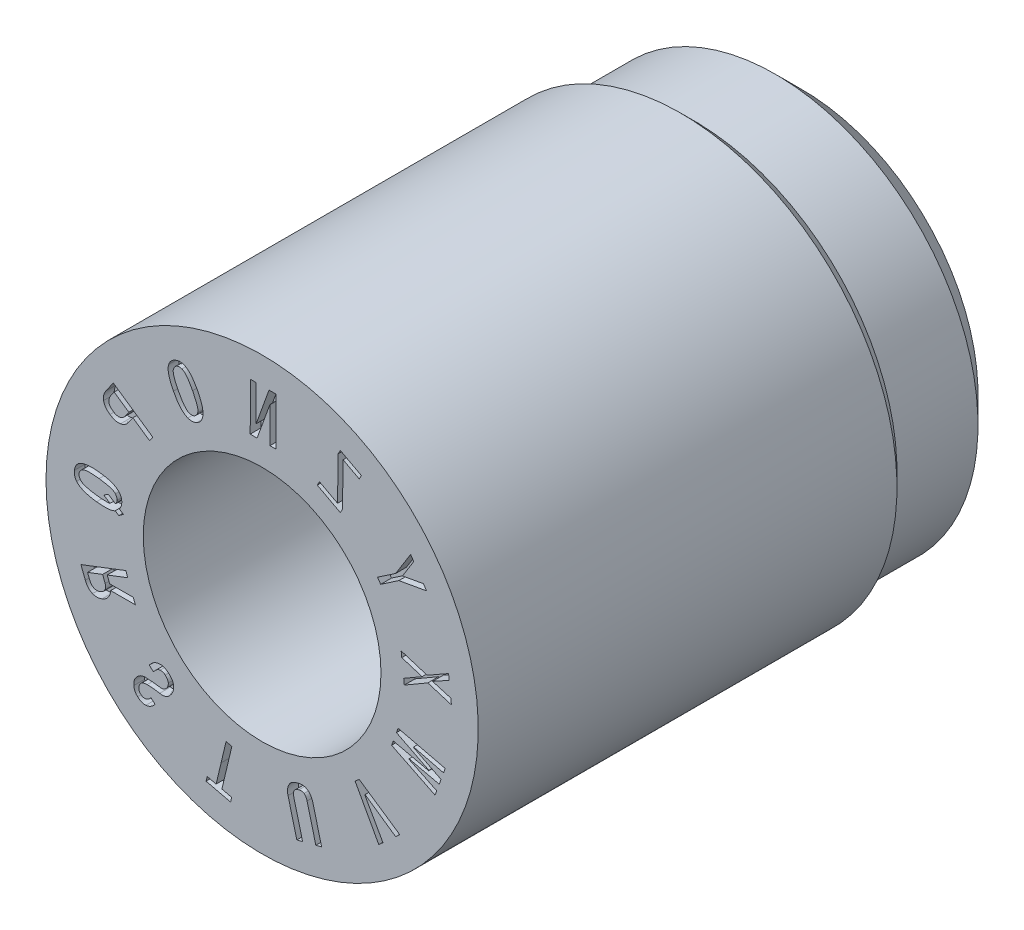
from build123d import *

# Parameters (mm, degrees)
CUT_EXTRUDE1_DEPTH = 0.2


with BuildPart() as part:
    # Sketch2 → Revolve1 (revolve)
    with BuildSketch(Plane(origin=(0, 0, 0), x_dir=(1, 0, 0), z_dir=(0, 1, 0)), mode=Mode.PRIVATE) as revolve1_sk:
        Polygon((3.249621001, 10), (1.15, 10), (1.15, 7.468), (2.2, 7.468), (2.2, 0), (4, 0), (4, 7.75), (3.75, 8), (3.75, 9.499621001), align=None)
    revolve(revolve1_sk.sketch.rotate(Axis((0, 0, -4.849143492), (0, 0, 1)), 180), axis=Axis((0, 0, -4.849143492), (0, 0, 1)))

    # Sketch7 → Cut-Extrude1 (cut)
    # profile 1 of 13: a face of its own
    with BuildSketch(Plane.XY):
        Polygon((3.053546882, 0.392480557), (2.573473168, 0.543387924), (2.584896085, 0.440311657), (2.961538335, 0.323248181), (2.619864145, 0.126430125), (2.631287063, 0.023353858), (3.066593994, 0.276026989), (3.503512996, 0.142929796), (3.491926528, 0.245969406), (3.154276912, 0.344633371), (3.462203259, 0.514992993), (3.450780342, 0.618069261), align=None)
    # profile 2 of 13: a face of its own
    with BuildSketch(Plane.XY):
        Polygon((2.986004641, 1.826017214), (2.603221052, 1.756872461), (2.600728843, 1.76057469), (2.806566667, 2.090772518), (2.748374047, 2.17645236), (2.472203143, 1.733386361), (2.136421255, 1.505786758), (2.194458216, 1.420169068), (2.530240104, 1.647768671), (3.044135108, 1.740181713), align=None)
    # profile 3 of 13: a face of its own
    with BuildSketch(Plane.XY):
        Polygon((1.837182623, 2.984767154), (1.446788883, 3.192726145), (1.406519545, 3.117068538), (1.396010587, 2.319843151), (1.061487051, 2.498074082), (1.021494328, 2.42320755), (1.44764493, 2.196246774), (1.487637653, 2.271113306), (1.498516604, 3.06899058), (1.7971899, 2.909900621), align=None)
    # profile 4 of 13: a face of its own
    with BuildSketch(Plane.XY):
        Polygon((-0.216255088, 3.501940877), (-0.220347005, 2.619822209), (-0.093635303, 2.619279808), (0.144786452, 3.278550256), (0.149311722, 3.278512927), (0.146210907, 2.61813939), (0.253311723, 2.617591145), (0.25740364, 3.499709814), (0.127675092, 3.5002771), (-0.110749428, 2.840671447), (-0.112257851, 2.84068389), (-0.109154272, 3.501392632), align=None)
    # profile 5 of 13: a face of its own
    with BuildSketch(Plane.XY):
        with BuildLine():
            add(Edge.make_bspline(
                [(-1.729374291, 2.98262397), (-1.731008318, 2.976912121), (-1.73434862, 2.96523587), (-1.737598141, 2.946947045), (-1.739421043, 2.927796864), (-1.73989398, 2.907786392), (-1.739195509, 2.886890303), (-1.736793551, 2.86506842), (-1.733524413, 2.842316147), (-1.728638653, 2.818709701), (-1.722168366, 2.794306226), (-1.714835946, 2.768885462), (-1.705775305, 2.74270965), (-1.695622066, 2.715570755), (-1.684040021, 2.687541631), (-1.671087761, 2.658559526), (-1.656856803, 2.628656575), (-1.646511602, 2.60863748), (-1.641244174, 2.598444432)],
                knots=[0, 0, 0, 0, 0.706757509, 1.444764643, 2.206913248, 2.994457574, 3.825681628, 4.693371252, 5.606017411, 6.56083591, 7.560518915, 8.610470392, 9.709055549, 10.8563712, 12.059009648, 13.318052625, 14.634442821, 16, 16, 16, 16], degree=3))
            add(Edge.make_bspline(
                [(-1.641244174, 2.598444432), (-1.635811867, 2.588115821), (-1.625167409, 2.567877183), (-1.608324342, 2.538808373), (-1.591962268, 2.511076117), (-1.575135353, 2.485254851), (-1.558718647, 2.460844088), (-1.542126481, 2.438208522), (-1.525287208, 2.417381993), (-1.508629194, 2.397998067), (-1.492015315, 2.38019884), (-1.475165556, 2.364301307), (-1.458562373, 2.349706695), (-1.441677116, 2.337002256), (-1.424861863, 2.325877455), (-1.4080493, 2.316367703), (-1.391146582, 2.308677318), (-1.379681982, 2.304670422), (-1.374064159, 2.302706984)],
                knots=[0, 0, 0, 0, 1.373774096, 2.691873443, 3.954807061, 5.16408426, 6.319665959, 7.417948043, 8.466946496, 9.472007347, 10.426643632, 11.331798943, 12.19837133, 13.027801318, 13.817360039, 14.570689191, 15.299616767, 16, 16, 16, 16], degree=3))
            add(Edge.make_bspline(
                [(-1.374064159, 2.302706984), (-1.367085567, 2.300155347), (-1.353362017, 2.2951375), (-1.332377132, 2.289806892), (-1.311416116, 2.287567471), (-1.29059895, 2.287173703), (-1.269928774, 2.289373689), (-1.249342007, 2.29393379), (-1.228954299, 2.300958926), (-1.215828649, 2.307338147), (-1.209179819, 2.310569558)],
                knots=[0, 0, 0, 0, 1.044490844, 2.054013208, 3.034543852, 4.001896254, 4.976620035, 5.94944278, 6.961285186, 8, 8, 8, 8], degree=3))
            add(Edge.make_bspline(
                [(-1.209179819, 2.310569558), (-1.202416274, 2.314365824), (-1.189145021, 2.32181476), (-1.171005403, 2.33510216), (-1.154597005, 2.34949821), (-1.140669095, 2.365751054), (-1.12821611, 2.382981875), (-1.118331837, 2.401970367), (-1.110105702, 2.42215935), (-1.106382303, 2.436355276), (-1.104493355, 2.443557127)],
                knots=[0, 0, 0, 0, 1.063112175, 2.086011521, 3.078717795, 4.05037152, 5.016112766, 5.988642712, 6.979601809, 8, 8, 8, 8], degree=3))
            add(Edge.make_bspline(
                [(-1.104493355, 2.443557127), (-1.102843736, 2.449266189), (-1.099465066, 2.460959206), (-1.096465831, 2.479316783), (-1.094560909, 2.498552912), (-1.0941141, 2.518684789), (-1.09509152, 2.539714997), (-1.097161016, 2.561726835), (-1.100946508, 2.584605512), (-1.105743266, 2.608460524), (-1.11227235, 2.633143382), (-1.119797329, 2.658844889), (-1.129070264, 2.685419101), (-1.139370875, 2.712981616), (-1.151166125, 2.741463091), (-1.164443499, 2.770761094), (-1.178889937, 2.801111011), (-1.189344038, 2.821439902), (-1.194682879, 2.831821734)],
                knots=[0, 0, 0, 0, 0.699060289, 1.431780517, 2.185628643, 2.973706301, 3.799840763, 4.663081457, 5.57484828, 6.528566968, 7.526638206, 8.579531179, 9.68064661, 10.839179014, 12.043340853, 13.308967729, 14.625707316, 16, 16, 16, 16], degree=3))
            add(Edge.make_bspline(
                [(-1.194682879, 2.831821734), (-1.200056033, 2.841954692), (-1.210592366, 2.86182463), (-1.227054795, 2.890534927), (-1.243258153, 2.917805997), (-1.259713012, 2.943337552), (-1.276146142, 2.967268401), (-1.292678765, 2.989538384), (-1.309098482, 3.010302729), (-1.325854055, 3.02919985), (-1.342391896, 3.046705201), (-1.359006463, 3.06259218), (-1.375634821, 3.076803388), (-1.392232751, 3.089512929), (-1.409088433, 3.100277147), (-1.425809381, 3.109826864), (-1.442723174, 3.117500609), (-1.454186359, 3.121509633), (-1.459803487, 3.123474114)],
                knots=[0, 0, 0, 0, 1.365114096, 2.676882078, 3.938888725, 5.140526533, 6.291695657, 7.393657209, 8.441474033, 9.441477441, 10.398776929, 11.307345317, 12.176177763, 13.001467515, 13.793283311, 14.554922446, 15.291890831, 16, 16, 16, 16], degree=3))
            add(Edge.make_bspline(
                [(-1.459803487, 3.123474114), (-1.466462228, 3.125349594), (-1.479668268, 3.129069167), (-1.499983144, 3.131995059), (-1.52039051, 3.132804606), (-1.540941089, 3.131535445), (-1.561620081, 3.128035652), (-1.582431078, 3.122285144), (-1.603402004, 3.114462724), (-1.617040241, 3.107726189), (-1.62397769, 3.104299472)],
                knots=[0, 0, 0, 0, 0.976897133, 1.937444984, 2.892524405, 3.859380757, 4.842164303, 5.851181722, 6.906946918, 8, 8, 8, 8], degree=3))
            add(Edge.make_bspline(
                [(-1.62397769, 3.104299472), (-1.630494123, 3.100735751), (-1.64327991, 3.093743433), (-1.660822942, 3.08134929), (-1.676663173, 3.067826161), (-1.69073552, 3.053126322), (-1.703240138, 3.037335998), (-1.713828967, 3.020265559), (-1.722684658, 3.001988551), (-1.727129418, 2.989122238), (-1.729374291, 2.98262397)],
                knots=[0, 0, 0, 0, 1.076833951, 2.112838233, 3.109604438, 4.094401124, 5.060642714, 6.026442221, 7.003233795, 8, 8, 8, 8], degree=3))
        make_face()
        with BuildLine():
            add(Edge.make_bspline(
                [(-1.48470361, 3.033618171), (-1.481304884, 3.03236822), (-1.474254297, 3.029775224), (-1.463775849, 3.024256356), (-1.453055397, 3.017164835), (-1.442104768, 3.008399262), (-1.430763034, 2.998315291), (-1.419225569, 2.986504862), (-1.407415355, 2.973158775), (-1.395168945, 2.958320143), (-1.382778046, 2.941846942), (-1.369876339, 2.923928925), (-1.35676128, 2.904403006), (-1.343439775, 2.883193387), (-1.32978376, 2.860468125), (-1.315739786, 2.836248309), (-1.301639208, 2.810378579), (-1.292141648, 2.792620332), (-1.287263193, 2.783498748)],
                knots=[0, 0, 0, 0, 0.535693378, 1.111284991, 1.748431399, 2.436238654, 3.186244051, 3.994178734, 4.878956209, 5.824301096, 6.841871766, 7.930239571, 9.093073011, 10.323688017, 11.638103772, 13.018336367, 14.468458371, 16, 16, 16, 16], degree=3))
            add(Edge.make_bspline(
                [(-1.287263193, 2.783498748), (-1.282416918, 2.774187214), (-1.27294076, 2.755979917), (-1.259706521, 2.729040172), (-1.247593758, 2.703228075), (-1.236509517, 2.678663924), (-1.226644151, 2.655212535), (-1.217785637, 2.633012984), (-1.210143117, 2.611980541), (-1.203596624, 2.592119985), (-1.19839131, 2.573359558), (-1.193867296, 2.555829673), (-1.190803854, 2.539407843), (-1.188881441, 2.524151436), (-1.188007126, 2.510062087), (-1.188114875, 2.497075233), (-1.189496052, 2.485239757), (-1.191478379, 2.477932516), (-1.1924193, 2.474464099)],
                knots=[0, 0, 0, 0, 1.532193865, 2.995973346, 4.380747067, 5.694013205, 6.929307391, 8.094137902, 9.182462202, 10.19533062, 11.145524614, 12.023925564, 12.837020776, 13.581992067, 14.267209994, 14.895995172, 15.47597886, 16, 16, 16, 16], degree=3))
            add(Edge.make_bspline(
                [(-1.1924193, 2.474464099), (-1.193907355, 2.470013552), (-1.196817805, 2.461308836), (-1.202567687, 2.449012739), (-1.20901322, 2.437655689), (-1.216204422, 2.427201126), (-1.22432974, 2.417844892), (-1.2334086, 2.409623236), (-1.243178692, 2.40216919), (-1.250351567, 2.39819951), (-1.253964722, 2.396199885)],
                knots=[0, 0, 0, 0, 1.10032407, 2.152096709, 3.178732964, 4.16193185, 5.124641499, 6.078744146, 7.032216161, 8, 8, 8, 8], degree=3))
            add(Edge.make_bspline(
                [(-1.253964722, 2.396199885), (-1.257332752, 2.39452094), (-1.264057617, 2.391168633), (-1.274965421, 2.387952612), (-1.286204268, 2.385433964), (-1.297994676, 2.384462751), (-1.310182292, 2.384807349), (-1.322857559, 2.385933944), (-1.335979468, 2.3885991), (-1.344759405, 2.391128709), (-1.3492597, 2.392425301)],
                knots=[0, 0, 0, 0, 0.920265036, 1.837471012, 2.776779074, 3.738947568, 4.726011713, 5.761705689, 6.852726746, 8, 8, 8, 8], degree=3))
            add(Edge.make_bspline(
                [(-1.3492597, 2.392425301), (-1.352656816, 2.393677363), (-1.359756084, 2.396293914), (-1.370305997, 2.401812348), (-1.380950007, 2.409209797), (-1.392093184, 2.417918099), (-1.403361, 2.428345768), (-1.415155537, 2.440156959), (-1.426958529, 2.453843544), (-1.439377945, 2.468941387), (-1.451925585, 2.485696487), (-1.464905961, 2.50395064), (-1.478194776, 2.523805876), (-1.491801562, 2.545278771), (-1.50558536, 2.568453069), (-1.519729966, 2.593130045), (-1.534261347, 2.619418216), (-1.54386504, 2.63754542), (-1.548801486, 2.646863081)],
                knots=[0, 0, 0, 0, 0.528063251, 1.103542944, 1.731455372, 2.417605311, 3.166044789, 3.97048745, 4.852517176, 5.802311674, 6.823421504, 7.90670989, 9.071136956, 10.309930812, 11.616407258, 13.006063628, 14.461070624, 16, 16, 16, 16], degree=3))
            add(Edge.make_bspline(
                [(-1.548801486, 2.646863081), (-1.553533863, 2.656037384), (-1.562771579, 2.673945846), (-1.575804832, 2.70039417), (-1.587910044, 2.725630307), (-1.598599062, 2.749880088), (-1.608309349, 2.772938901), (-1.616986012, 2.794811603), (-1.62443966, 2.815566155), (-1.630925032, 2.835147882), (-1.636199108, 2.853644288), (-1.640285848, 2.871031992), (-1.643391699, 2.887194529), (-1.64528838, 2.902263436), (-1.646020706, 2.916222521), (-1.645685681, 2.929082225), (-1.644487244, 2.940854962), (-1.642495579, 2.948112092), (-1.64154401, 2.951579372)],
                knots=[0, 0, 0, 0, 1.528867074, 2.984386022, 4.366875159, 5.673880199, 6.908886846, 8.072441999, 9.158443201, 10.174578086, 11.127064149, 12.005972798, 12.819293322, 13.563507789, 14.253686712, 14.887117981, 15.468292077, 16, 16, 16, 16], degree=3))
            add(Edge.make_bspline(
                [(-1.64154401, 2.951579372), (-1.640039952, 2.956023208), (-1.637112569, 2.96467235), (-1.631677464, 2.976876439), (-1.625592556, 2.988077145), (-1.618779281, 2.998168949), (-1.611307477, 3.007310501), (-1.602837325, 3.015099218), (-1.594005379, 3.022328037), (-1.587376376, 3.025973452), (-1.584083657, 3.02778418)],
                knots=[0, 0, 0, 0, 1.148548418, 2.235447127, 3.267559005, 4.266574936, 5.214324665, 6.150945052, 7.081548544, 8, 8, 8, 8], degree=3))
            add(Edge.make_bspline(
                [(-1.584083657, 3.02778418), (-1.580414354, 3.029582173), (-1.573048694, 3.033191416), (-1.561390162, 3.036995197), (-1.549366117, 3.039672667), (-1.537056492, 3.041036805), (-1.524402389, 3.041114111), (-1.51142738, 3.039849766), (-1.498062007, 3.037553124), (-1.489198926, 3.034942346), (-1.48470361, 3.033618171)],
                knots=[0, 0, 0, 0, 0.957927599, 1.922917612, 2.869290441, 3.844910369, 4.823433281, 5.833338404, 6.901078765, 8, 8, 8, 8], degree=3))
        make_face(mode=Mode.SUBTRACT)
    # profile 6 of 13: a face of its own
    with BuildSketch(Plane.XY):
        with BuildLine():
            add(Edge.make_bspline(
                [(-2.888817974, 1.979295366), (-2.893680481, 1.971884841), (-2.903148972, 1.957454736), (-2.915107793, 1.935083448), (-2.924294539, 1.912654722), (-2.931515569, 1.890430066), (-2.935731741, 1.868099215), (-2.938065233, 1.845913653), (-2.937565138, 1.823658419), (-2.935379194, 1.809048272), (-2.934281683, 1.801712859)],
                knots=[0, 0, 0, 0, 1.129469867, 2.199354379, 3.227072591, 4.21583249, 5.172262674, 6.118162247, 7.055173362, 8, 8, 8, 8], degree=3))
            add(Edge.make_bspline(
                [(-2.934281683, 1.801712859), (-2.93258243, 1.793890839), (-2.929185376, 1.778253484), (-2.920828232, 1.755587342), (-2.909796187, 1.733817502), (-2.896208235, 1.712845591), (-2.879984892, 1.692681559), (-2.861276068, 1.673271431), (-2.839926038, 1.654609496), (-2.82421104, 1.643351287), (-2.816118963, 1.637554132)],
                knots=[0, 0, 0, 0, 0.92398886, 1.847188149, 2.781782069, 3.738954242, 4.729060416, 5.767402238, 6.850375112, 8, 8, 8, 8], degree=3))
            add(Edge.make_bspline(
                [(-2.816118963, 1.637554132), (-2.807838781, 1.632123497), (-2.791707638, 1.621543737), (-2.766833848, 1.608028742), (-2.741986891, 1.59764755), (-2.717491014, 1.589416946), (-2.693069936, 1.584347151), (-2.668842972, 1.581990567), (-2.644756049, 1.582148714), (-2.628945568, 1.584485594), (-2.621028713, 1.58565575)],
                knots=[0, 0, 0, 0, 1.146139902, 2.232867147, 3.271325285, 4.260259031, 5.220169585, 6.151590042, 7.074437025, 8, 8, 8, 8], degree=3))
            add(Edge.make_bspline(
                [(-2.621028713, 1.58565575), (-2.613425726, 1.586967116), (-2.598371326, 1.589563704), (-2.576635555, 1.596737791), (-2.555829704, 1.606049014), (-2.535995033, 1.617763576), (-2.517084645, 1.631805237), (-2.499333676, 1.648413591), (-2.482269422, 1.667235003), (-2.472178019, 1.681285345), (-2.467002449, 1.688491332)],
                knots=[0, 0, 0, 0, 0.969249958, 1.919177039, 2.869493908, 3.831815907, 4.81057165, 5.825780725, 6.884909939, 8, 8, 8, 8], degree=3))
            Line((-2.467002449, 1.688491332), (-2.392293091, 1.79668099))
            Line((-2.392293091, 1.79668099), (-2.082759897, 1.583334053))
            Line((-2.082759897, 1.583334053), (-2.023722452, 1.669070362))
            Line((-2.023722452, 1.669070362), (-2.755071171, 2.173221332))
            Line((-2.755071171, 2.173221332), (-2.888817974, 1.979295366))
        make_face()
        with BuildLine():
            Line((-2.739077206, 2.035854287), (-2.467167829, 1.848371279))
            Line((-2.467167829, 1.848371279), (-2.526361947, 1.762575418))
            add(Edge.make_bspline(
                [(-2.526361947, 1.762575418), (-2.530227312, 1.75718067), (-2.537748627, 1.746683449), (-2.550178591, 1.732459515), (-2.563052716, 1.719875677), (-2.576604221, 1.709268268), (-2.590438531, 1.699986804), (-2.605116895, 1.692959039), (-2.620147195, 1.687213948), (-2.630584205, 1.684981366), (-2.635768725, 1.683872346)],
                knots=[0, 0, 0, 0, 1.150051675, 2.237796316, 3.270584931, 4.266229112, 5.218127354, 6.152114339, 7.082074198, 8, 8, 8, 8], degree=3))
            add(Edge.make_bspline(
                [(-2.635768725, 1.683872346), (-2.640561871, 1.683179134), (-2.650156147, 1.681791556), (-2.664944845, 1.681919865), (-2.679974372, 1.683805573), (-2.695439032, 1.687222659), (-2.710964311, 1.693054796), (-2.72702366, 1.700017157), (-2.743354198, 1.708952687), (-2.753989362, 1.716034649), (-2.759478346, 1.719689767)],
                knots=[0, 0, 0, 0, 0.878374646, 1.758212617, 2.674828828, 3.625830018, 4.626040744, 5.680545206, 6.80289116, 8, 8, 8, 8], degree=3))
            add(Edge.make_bspline(
                [(-2.759478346, 1.719689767), (-2.764857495, 1.723497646), (-2.77532048, 1.730904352), (-2.789359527, 1.743196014), (-2.801926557, 1.755464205), (-2.812553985, 1.768259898), (-2.821523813, 1.781288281), (-2.828665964, 1.79475444), (-2.833978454, 1.808528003), (-2.836117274, 1.817997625), (-2.837171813, 1.822666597)],
                knots=[0, 0, 0, 0, 1.194100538, 2.322645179, 3.378915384, 4.375148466, 5.333320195, 6.241689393, 7.133069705, 8, 8, 8, 8], degree=3))
            add(Edge.make_bspline(
                [(-2.837171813, 1.822666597), (-2.837682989, 1.827722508), (-2.838710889, 1.837889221), (-2.837658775, 1.853358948), (-2.835446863, 1.869011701), (-2.831207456, 1.884859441), (-2.825547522, 1.90095195), (-2.818165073, 1.917322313), (-2.809061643, 1.933822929), (-2.801921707, 1.94456593), (-2.798271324, 1.950058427)],
                knots=[0, 0, 0, 0, 0.89405284, 1.797812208, 2.723562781, 3.677016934, 4.683063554, 5.727408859, 6.838108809, 8, 8, 8, 8], degree=3))
            Line((-2.798271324, 1.950058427), (-2.739077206, 2.035854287))
        make_face(mode=Mode.SUBTRACT)
    # profile 7 of 13: a face of its own
    with BuildSketch(Plane.XY):
        with BuildLine():
            add(Edge.make_bspline(
                [(-3.433597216, 0.258591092), (-3.429830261, 0.254012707), (-3.422145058, 0.244672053), (-3.408696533, 0.23198553), (-3.394084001, 0.219473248), (-3.377685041, 0.207950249), (-3.360031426, 0.196575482), (-3.340527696, 0.186464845), (-3.319842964, 0.176221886), (-3.297385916, 0.167214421), (-3.273504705, 0.158491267), (-3.248134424, 0.150201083), (-3.22109592, 0.143042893), (-3.192713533, 0.135805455), (-3.162664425, 0.12977328), (-3.131172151, 0.123970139), (-3.098117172, 0.118991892), (-3.075568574, 0.116101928), (-3.064032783, 0.114623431)],
                knots=[0, 0, 0, 0, 0.700804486, 1.429755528, 2.18357768, 2.97531138, 3.798909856, 4.666281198, 5.572552, 6.528929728, 7.526805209, 8.580813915, 9.685209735, 10.835401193, 12.045715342, 13.310353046, 14.62398523, 16, 16, 16, 16], degree=3))
            add(Edge.make_bspline(
                [(-3.064032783, 0.114623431), (-3.053959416, 0.113477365), (-3.034237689, 0.111233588), (-3.00516467, 0.10848964), (-2.977235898, 0.106592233), (-2.950471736, 0.105264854), (-2.924875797, 0.104630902), (-2.900433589, 0.104490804), (-2.877147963, 0.105276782), (-2.855022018, 0.106668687), (-2.834105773, 0.108596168), (-2.814300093, 0.111300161), (-2.795687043, 0.114618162), (-2.778206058, 0.118749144), (-2.761912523, 0.123378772), (-2.746746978, 0.128662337), (-2.732791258, 0.134794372), (-2.72408972, 0.139505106), (-2.719840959, 0.141805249)],
                knots=[0, 0, 0, 0, 1.389457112, 2.720291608, 4.001750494, 5.225641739, 6.392541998, 7.510561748, 8.57498812, 9.584922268, 10.548664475, 11.452995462, 12.323735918, 13.138724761, 13.913705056, 14.644292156, 15.338038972, 16, 16, 16, 16], degree=3))
            Line((-2.719840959, 0.141805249), (-2.652456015, 0.097414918))
            Line((-2.652456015, 0.097414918), (-2.567621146, 0.160199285))
            Line((-2.567621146, 0.160199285), (-2.643505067, 0.210092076))
            add(Edge.make_bspline(
                [(-2.643505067, 0.210092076), (-2.63768344, 0.217189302), (-2.625959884, 0.231481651), (-2.613083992, 0.256639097), (-2.603419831, 0.284243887), (-2.600442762, 0.303894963), (-2.598914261, 0.313984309)],
                knots=[0, 0, 0, 0, 0.956904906, 1.927009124, 2.935675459, 4, 4, 4, 4], degree=3))
            add(Edge.make_bspline(
                [(-2.598914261, 0.313984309), (-2.598217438, 0.321312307), (-2.596849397, 0.33569903), (-2.597070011, 0.357077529), (-2.5993179, 0.37766691), (-2.603617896, 0.397494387), (-2.609628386, 0.416590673), (-2.617790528, 0.43484365), (-2.627688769, 0.452452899), (-2.635842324, 0.463270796), (-2.639971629, 0.468749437)],
                knots=[0, 0, 0, 0, 1.07304745, 2.106665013, 3.11194997, 4.088692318, 5.06134729, 6.026188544, 7.000378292, 8, 8, 8, 8], degree=3))
            add(Edge.make_bspline(
                [(-2.639971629, 0.468749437), (-2.643759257, 0.473305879), (-2.651474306, 0.482586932), (-2.664559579, 0.495594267), (-2.679424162, 0.507688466), (-2.695393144, 0.519583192), (-2.713150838, 0.530538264), (-2.732286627, 0.540965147), (-2.752865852, 0.550984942), (-2.774926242, 0.560237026), (-2.798521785, 0.568820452), (-2.823529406, 0.576946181), (-2.850091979, 0.584382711), (-2.878146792, 0.59107692), (-2.90767135, 0.597410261), (-2.938760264, 0.602914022), (-2.971267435, 0.608114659), (-2.99349441, 0.610865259), (-3.004816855, 0.612266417)],
                knots=[0, 0, 0, 0, 0.708749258, 1.443656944, 2.203058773, 3.000131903, 3.824600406, 4.697053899, 5.607066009, 6.562126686, 7.558030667, 8.610656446, 9.707750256, 10.85759157, 12.06137803, 13.320330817, 14.634973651, 16, 16, 16, 16], degree=3))
            add(Edge.make_bspline(
                [(-3.004816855, 0.612266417), (-3.016353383, 0.613551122), (-3.03895497, 0.61606803), (-3.072247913, 0.618961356), (-3.104227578, 0.620861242), (-3.134887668, 0.621670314), (-3.164172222, 0.621784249), (-3.192138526, 0.620730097), (-3.218729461, 0.618765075), (-3.243982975, 0.615875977), (-3.267873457, 0.612214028), (-3.290440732, 0.607508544), (-3.311658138, 0.601750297), (-3.331614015, 0.595222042), (-3.350164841, 0.587676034), (-3.367342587, 0.579100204), (-3.383346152, 0.569838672), (-3.393005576, 0.562520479), (-3.397748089, 0.558927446)],
                knots=[0, 0, 0, 0, 1.373502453, 2.69087328, 3.953892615, 5.16362336, 6.319707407, 7.418497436, 8.474284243, 9.474002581, 10.425473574, 11.333293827, 12.200159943, 13.025655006, 13.816457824, 14.56725867, 15.296563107, 16, 16, 16, 16], degree=3))
            add(Edge.make_bspline(
                [(-3.397748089, 0.558927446), (-3.40302314, 0.554543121), (-3.413478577, 0.545853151), (-3.427247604, 0.530818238), (-3.439569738, 0.514689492), (-3.449765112, 0.496880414), (-3.458809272, 0.478050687), (-3.465605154, 0.457655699), (-3.47113645, 0.436083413), (-3.473221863, 0.421106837), (-3.474289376, 0.413440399)],
                knots=[0, 0, 0, 0, 0.973613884, 1.92975554, 2.889811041, 3.851702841, 4.840347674, 5.85305095, 6.900987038, 8, 8, 8, 8], degree=3))
            add(Edge.make_bspline(
                [(-3.474289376, 0.413440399), (-3.47498385, 0.406112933), (-3.47634728, 0.391727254), (-3.476159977, 0.370341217), (-3.473787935, 0.349752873), (-3.469926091, 0.329847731), (-3.463618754, 0.310817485), (-3.455689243, 0.292474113), (-3.44570402, 0.274905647), (-3.437659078, 0.264064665), (-3.433597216, 0.258591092)],
                knots=[0, 0, 0, 0, 1.073418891, 2.107394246, 3.113027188, 4.093976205, 5.060011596, 6.031670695, 7.006197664, 8, 8, 8, 8], degree=3))
        make_face()
        with BuildLine():
            add(Edge.make_bspline(
                [(-3.358781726, 0.313450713), (-3.361611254, 0.317179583), (-3.367093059, 0.324403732), (-3.374083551, 0.335692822), (-3.37993197, 0.346879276), (-3.384220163, 0.358253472), (-3.387711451, 0.369504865), (-3.389334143, 0.38088635), (-3.390036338, 0.392175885), (-3.389429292, 0.399638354), (-3.38912504, 0.403378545)],
                knots=[0, 0, 0, 0, 1.151888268, 2.231617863, 3.265601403, 4.253923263, 5.221346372, 6.158870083, 7.077225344, 8, 8, 8, 8], degree=3))
            add(Edge.make_bspline(
                [(-3.38912504, 0.403378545), (-3.388537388, 0.407429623), (-3.387370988, 0.415470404), (-3.383868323, 0.427161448), (-3.379531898, 0.438582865), (-3.37349677, 0.449385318), (-3.366488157, 0.459808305), (-3.358316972, 0.469894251), (-3.348753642, 0.479415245), (-3.3416839, 0.485299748), (-3.338083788, 0.488296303)],
                knots=[0, 0, 0, 0, 0.964087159, 1.913568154, 2.871332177, 3.839731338, 4.823603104, 5.831358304, 6.895666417, 8, 8, 8, 8], degree=3))
            add(Edge.make_bspline(
                [(-3.338083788, 0.488296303), (-3.335171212, 0.490423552), (-3.329086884, 0.494867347), (-3.318461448, 0.500097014), (-3.30656952, 0.505074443), (-3.293111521, 0.509147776), (-3.278193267, 0.512616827), (-3.261839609, 0.515524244), (-3.243976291, 0.51778178), (-3.224651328, 0.519205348), (-3.203840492, 0.520297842), (-3.181552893, 0.520476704), (-3.157761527, 0.520320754), (-3.132514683, 0.519340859), (-3.105768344, 0.517663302), (-3.077554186, 0.515532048), (-3.047833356, 0.51262158), (-3.027549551, 0.510358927), (-3.017136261, 0.509197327)],
                knots=[0, 0, 0, 0, 0.52827602, 1.103561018, 1.731564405, 2.419028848, 3.163240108, 3.978095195, 4.855033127, 5.803817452, 6.820634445, 7.912160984, 9.073427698, 10.311327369, 11.618637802, 13.005392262, 14.462629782, 16, 16, 16, 16], degree=3))
            add(Edge.make_bspline(
                [(-3.017136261, 0.509197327), (-3.0069331, 0.507902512), (-2.987040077, 0.505378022), (-2.957962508, 0.501338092), (-2.930456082, 0.49692625), (-2.904510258, 0.49224644), (-2.880201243, 0.487194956), (-2.857408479, 0.482080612), (-2.836098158, 0.476702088), (-2.816489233, 0.470590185), (-2.798240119, 0.464823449), (-2.781721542, 0.458402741), (-2.766749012, 0.451633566), (-2.753231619, 0.444903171), (-2.741356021, 0.437623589), (-2.730945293, 0.430262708), (-2.722167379, 0.422413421), (-2.717264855, 0.416791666), (-2.714910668, 0.414092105)],
                knots=[0, 0, 0, 0, 1.531324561, 2.985611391, 4.370687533, 5.678814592, 6.910634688, 8.067006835, 9.156839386, 10.181653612, 11.124605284, 12.005763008, 12.818241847, 13.570812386, 14.252156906, 14.890127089, 15.467040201, 16, 16, 16, 16], degree=3))
            add(Edge.make_bspline(
                [(-2.714910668, 0.414092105), (-2.712085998, 0.410360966), (-2.706613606, 0.40313242), (-2.699534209, 0.391838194), (-2.693892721, 0.380472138), (-2.689308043, 0.369218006), (-2.686001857, 0.357951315), (-2.684350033, 0.346659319), (-2.683658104, 0.335366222), (-2.684263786, 0.327904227), (-2.684567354, 0.324164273)],
                knots=[0, 0, 0, 0, 1.151942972, 2.231723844, 3.276226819, 4.272509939, 5.221214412, 6.158782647, 7.077181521, 8, 8, 8, 8], degree=3))
            add(Edge.make_bspline(
                [(-2.684567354, 0.324164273), (-2.685715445, 0.316514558), (-2.687872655, 0.302141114), (-2.694311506, 0.282672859), (-2.703333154, 0.266676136), (-2.711605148, 0.258847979), (-2.715569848, 0.255096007)],
                knots=[0, 0, 0, 0, 1.195186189, 2.245697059, 3.159176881, 4, 4, 4, 4], degree=3))
            Line((-2.715569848, 0.255096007), (-2.845985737, 0.343341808))
            Line((-2.845985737, 0.343341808), (-2.929672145, 0.289591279))
            Line((-2.929672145, 0.289591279), (-2.81605192, 0.212473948))
            add(Edge.make_bspline(
                [(-2.81605192, 0.212473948), (-2.823327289, 0.211512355), (-2.838627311, 0.209490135), (-2.862776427, 0.207935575), (-2.889083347, 0.206978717), (-2.917521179, 0.207190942), (-2.948059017, 0.208395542), (-2.980763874, 0.21064933), (-3.015605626, 0.213736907), (-3.039552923, 0.21637455), (-3.051876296, 0.217731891)],
                knots=[0, 0, 0, 0, 0.744522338, 1.565722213, 2.454318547, 3.415565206, 4.450729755, 5.555238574, 6.741916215, 8, 8, 8, 8], degree=3))
            add(Edge.make_bspline(
                [(-3.051876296, 0.217731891), (-3.062257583, 0.218996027), (-3.082500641, 0.221461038), (-3.112065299, 0.225678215), (-3.140010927, 0.230167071), (-3.16637893, 0.235023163), (-3.191178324, 0.239910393), (-3.214402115, 0.245170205), (-3.236009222, 0.250707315), (-3.255991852, 0.256552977), (-3.274368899, 0.262663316), (-3.291127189, 0.269187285), (-3.30640045, 0.275672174), (-3.320036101, 0.282623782), (-3.33211104, 0.289780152), (-3.342597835, 0.297301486), (-3.351508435, 0.305073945), (-3.356432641, 0.310745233), (-3.358781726, 0.313450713)],
                knots=[0, 0, 0, 0, 1.534946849, 2.993079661, 4.383024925, 5.688960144, 6.928182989, 8.092741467, 9.183505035, 10.201532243, 11.148125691, 12.024906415, 12.840537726, 13.58242723, 14.269737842, 14.898653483, 15.474604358, 16, 16, 16, 16], degree=3))
        make_face(mode=Mode.SUBTRACT)
    # profile 8 of 13: a face of its own
    with BuildSketch(Plane.XY):
        with BuildLine():
            add(Edge.make_bspline(
                [(-3.272398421, -1.247843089), (-3.268892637, -1.256418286), (-3.262035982, -1.273189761), (-3.249190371, -1.296642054), (-3.234888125, -1.318177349), (-3.218855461, -1.337736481), (-3.2012654, -1.355408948), (-3.181804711, -1.370801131), (-3.160866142, -1.384484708), (-3.145730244, -1.391667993), (-3.138083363, -1.395297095)],
                knots=[0, 0, 0, 0, 1.084282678, 2.120653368, 3.125624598, 4.108213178, 5.078060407, 6.039772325, 7.009663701, 8, 8, 8, 8], degree=3))
            add(Edge.make_bspline(
                [(-3.138083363, -1.395297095), (-3.131657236, -1.397886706), (-3.118800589, -1.403067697), (-3.098445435, -1.40812137), (-3.077294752, -1.410854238), (-3.055364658, -1.41141237), (-3.032646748, -1.409569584), (-3.0091997, -1.405304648), (-2.984874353, -1.399102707), (-2.968758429, -1.393179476), (-2.960504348, -1.39014578)],
                knots=[0, 0, 0, 0, 0.910593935, 1.821810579, 2.749769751, 3.711603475, 4.702430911, 5.742521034, 6.843788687, 8, 8, 8, 8], degree=3))
            add(Edge.make_bspline(
                [(-2.960504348, -1.39014578), (-2.952957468, -1.38706982), (-2.938203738, -1.381056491), (-2.917481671, -1.369990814), (-2.898377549, -1.357892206), (-2.88102486, -1.344356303), (-2.865479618, -1.329407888), (-2.851490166, -1.313225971), (-2.839155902, -1.295704), (-2.832537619, -1.283046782), (-2.829218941, -1.276699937)],
                knots=[0, 0, 0, 0, 1.099613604, 2.149683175, 3.16650134, 4.149406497, 5.115350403, 6.073369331, 7.033908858, 8, 8, 8, 8], degree=3))
            add(Edge.make_bspline(
                [(-2.829218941, -1.276699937), (-2.824976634, -1.267981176), (-2.816897, -1.25137597), (-2.808715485, -1.22611576), (-2.803662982, -1.202310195), (-2.80360523, -1.18682919), (-2.803577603, -1.179423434)],
                knots=[0, 0, 0, 0, 1.143023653, 2.176931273, 3.127885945, 4, 4, 4, 4], degree=3))
            Line((-2.803577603, -1.179423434), (-2.3463857, -1.178752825))
            Line((-2.3463857, -1.178752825), (-2.385315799, -1.077135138))
            Line((-2.385315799, -1.077135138), (-2.821353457, -1.079510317))
            Line((-2.821353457, -1.079510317), (-2.866751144, -0.960937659))
            Line((-2.866751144, -0.960937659), (-2.485943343, -0.814787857))
            Line((-2.485943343, -0.814787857), (-2.523016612, -0.718489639))
            Line((-2.523016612, -0.718489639), (-3.353311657, -1.037207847))
            Line((-3.353311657, -1.037207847), (-3.272398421, -1.247843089))
        make_face()
        with BuildLine():
            add(Edge.make_bspline(
                [(-2.90530558, -1.116520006), (-2.903801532, -1.12071747), (-2.900818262, -1.129043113), (-2.898211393, -1.14193962), (-2.896480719, -1.154827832), (-2.896397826, -1.167817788), (-2.897570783, -1.18086703), (-2.899989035, -1.194009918), (-2.904119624, -1.207083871), (-2.907568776, -1.215676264), (-2.909318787, -1.220035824)],
                knots=[0, 0, 0, 0, 1.004294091, 1.992010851, 2.960247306, 3.933390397, 4.914090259, 5.912041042, 6.940623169, 8, 8, 8, 8], degree=3))
            add(Edge.make_bspline(
                [(-2.909318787, -1.220035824), (-2.911201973, -1.223903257), (-2.914974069, -1.231649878), (-2.92250053, -1.242437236), (-2.931448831, -1.252508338), (-2.941989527, -1.26186666), (-2.953791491, -1.270739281), (-2.967169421, -1.278830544), (-2.981959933, -1.286235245), (-2.992464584, -1.290543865), (-2.997876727, -1.292763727)],
                knots=[0, 0, 0, 0, 0.87676147, 1.756187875, 2.674094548, 3.620452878, 4.627958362, 5.683481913, 6.80649746, 8, 8, 8, 8], degree=3))
            add(Edge.make_bspline(
                [(-2.997876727, -1.292763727), (-3.003086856, -1.294625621), (-3.013287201, -1.298270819), (-3.028719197, -1.302278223), (-3.043806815, -1.304513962), (-3.058507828, -1.305509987), (-3.072923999, -1.304869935), (-3.086998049, -1.30267882), (-3.100812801, -1.299157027), (-3.109575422, -1.295587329), (-3.113999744, -1.293784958)],
                knots=[0, 0, 0, 0, 1.11294805, 2.178919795, 3.20157159, 4.177691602, 5.13953141, 6.098146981, 7.039738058, 8, 8, 8, 8], degree=3))
            add(Edge.make_bspline(
                [(-3.113999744, -1.293784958), (-3.118340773, -1.291261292), (-3.127021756, -1.286214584), (-3.139314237, -1.277202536), (-3.150501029, -1.266540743), (-3.161241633, -1.254770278), (-3.17089635, -1.241417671), (-3.179704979, -1.226706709), (-3.188052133, -1.210833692), (-3.192578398, -1.199472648), (-3.194901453, -1.193641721)],
                knots=[0, 0, 0, 0, 0.915536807, 1.830846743, 2.771888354, 3.729772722, 4.733603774, 5.770860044, 6.855919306, 8, 8, 8, 8], degree=3))
            Line((-3.194901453, -1.193641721), (-3.230603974, -1.100619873))
            Line((-3.230603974, -1.100619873), (-2.952385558, -0.993823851))
            Line((-2.952385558, -0.993823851), (-2.90530558, -1.116520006))
        make_face(mode=Mode.SUBTRACT)
    # profile 9 of 13: a face of its own
    with BuildSketch(Plane.XY):
        with BuildLine():
            add(Edge.make_bspline(
                [(-2.127883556, -2.348291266), (-2.107439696, -2.348752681), (-2.067295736, -2.349658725), (-2.008181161, -2.354245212), (-1.951273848, -2.3611192), (-1.914322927, -2.368042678), (-1.896170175, -2.371443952)],
                knots=[0, 0, 0, 0, 1.052096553, 2.06591721, 3.049849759, 4, 4, 4, 4], degree=3))
            add(Edge.make_bspline(
                [(-1.896170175, -2.371443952), (-1.886706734, -2.373108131), (-1.868307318, -2.376343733), (-1.840886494, -2.377314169), (-1.81480926, -2.374640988), (-1.789969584, -2.368947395), (-1.766558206, -2.35936063), (-1.744480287, -2.346540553), (-1.723689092, -2.330285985), (-1.711508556, -2.317264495), (-1.705271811, -2.31059716)],
                knots=[0, 0, 0, 0, 1.091982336, 2.123100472, 3.10858267, 4.066533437, 5.01132608, 5.97430108, 6.962790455, 8, 8, 8, 8], degree=3))
            add(Edge.make_bspline(
                [(-1.705271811, -2.31059716), (-1.699408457, -2.303544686), (-1.687954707, -2.289768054), (-1.672956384, -2.268069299), (-1.660616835, -2.245919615), (-1.650936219, -2.223386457), (-1.643473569, -2.200657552), (-1.638810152, -2.177491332), (-1.63636091, -2.154003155), (-1.636915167, -2.138257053), (-1.637192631, -2.130374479)],
                knots=[0, 0, 0, 0, 1.112155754, 2.17253694, 3.194540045, 4.182471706, 5.143418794, 6.090767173, 7.044228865, 8, 8, 8, 8], degree=3))
            add(Edge.make_bspline(
                [(-1.637192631, -2.130374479), (-1.637922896, -2.123025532), (-1.639388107, -2.108280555), (-1.645056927, -2.08669635), (-1.652784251, -2.065504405), (-1.663041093, -2.044818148), (-1.675891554, -2.024663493), (-1.690832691, -2.004739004), (-1.708631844, -1.985612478), (-1.721740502, -1.973566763), (-1.728468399, -1.967384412)],
                knots=[0, 0, 0, 0, 0.923130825, 1.852176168, 2.78363981, 3.743418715, 4.73542045, 5.771974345, 6.85648644, 8, 8, 8, 8], degree=3))
            add(Edge.make_bspline(
                [(-1.728468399, -1.967384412), (-1.735153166, -1.961755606), (-1.748222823, -1.950750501), (-1.768703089, -1.936488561), (-1.789181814, -1.924454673), (-1.809739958, -1.915048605), (-1.830301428, -1.907786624), (-1.850961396, -1.903124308), (-1.871700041, -1.900630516), (-1.885495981, -1.900999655), (-1.892375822, -1.90118374)],
                knots=[0, 0, 0, 0, 1.155564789, 2.259291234, 3.297105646, 4.29364905, 5.245588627, 6.176376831, 7.090584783, 8, 8, 8, 8], degree=3))
            add(Edge.make_bspline(
                [(-1.892375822, -1.90118374), (-1.900670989, -1.901963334), (-1.91700064, -1.903498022), (-1.940798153, -1.908466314), (-1.963521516, -1.915319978), (-1.985099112, -1.924480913), (-2.005414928, -1.935940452), (-2.024782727, -1.94919255), (-2.042995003, -1.964675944), (-2.053879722, -1.976511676), (-2.05940018, -1.982514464)],
                knots=[0, 0, 0, 0, 1.047030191, 2.061156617, 3.050997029, 4.027659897, 5.002223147, 5.979391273, 6.975197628, 8, 8, 8, 8], degree=3))
            Line((-2.05940018, -1.982514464), (-2.089174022, -2.016591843))
            Line((-2.089174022, -2.016591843), (-2.011236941, -2.084809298))
            Line((-2.011236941, -2.084809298), (-1.984530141, -2.054354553))
            add(Edge.make_bspline(
                [(-1.984530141, -2.054354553), (-1.980587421, -2.050047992), (-1.972938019, -2.041692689), (-1.960924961, -2.0304078), (-1.94875001, -2.020754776), (-1.936514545, -2.012629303), (-1.924040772, -2.006185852), (-1.911512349, -2.001238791), (-1.898818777, -1.997952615), (-1.890284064, -1.997018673), (-1.886059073, -1.996556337)],
                knots=[0, 0, 0, 0, 1.195850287, 2.320109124, 3.372200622, 4.375538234, 5.324044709, 6.242877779, 7.130161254, 8, 8, 8, 8], degree=3))
            add(Edge.make_bspline(
                [(-1.886059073, -1.996556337), (-1.881900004, -1.996346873), (-1.873619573, -1.995929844), (-1.861326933, -1.997167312), (-1.849250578, -1.999146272), (-1.837630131, -2.002800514), (-1.826270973, -2.007358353), (-1.815246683, -2.013209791), (-1.804669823, -2.02050007), (-1.797927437, -2.025998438), (-1.794497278, -2.028795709)],
                knots=[0, 0, 0, 0, 1.000453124, 1.991835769, 2.965287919, 3.939760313, 4.915066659, 5.907269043, 6.9353322, 8, 8, 8, 8], degree=3))
            add(Edge.make_bspline(
                [(-1.794497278, -2.028795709), (-1.790190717, -2.032738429), (-1.781835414, -2.040387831), (-1.770550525, -2.052400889), (-1.760897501, -2.064575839), (-1.752772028, -2.076811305), (-1.746328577, -2.089285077), (-1.741381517, -2.101813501), (-1.73809534, -2.114507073), (-1.737161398, -2.123041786), (-1.736699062, -2.127266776)],
                knots=[0, 0, 0, 0, 1.195850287, 2.320109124, 3.372200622, 4.375538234, 5.324044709, 6.242877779, 7.130161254, 8, 8, 8, 8], degree=3))
            add(Edge.make_bspline(
                [(-1.736699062, -2.127266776), (-1.736548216, -2.131992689), (-1.736249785, -2.141342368), (-1.737264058, -2.15533437), (-1.739831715, -2.168996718), (-1.743881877, -2.182319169), (-1.749243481, -2.195344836), (-1.756370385, -2.207877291), (-1.764366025, -2.22046524), (-1.770930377, -2.228143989), (-1.774273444, -2.232054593)],
                knots=[0, 0, 0, 0, 0.99140166, 1.961374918, 2.936080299, 3.901155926, 4.878043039, 5.883613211, 6.922174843, 8, 8, 8, 8], degree=3))
            add(Edge.make_bspline(
                [(-1.774273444, -2.232054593), (-1.778058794, -2.236048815), (-1.785518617, -2.243920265), (-1.798120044, -2.253945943), (-1.81172887, -2.26196358), (-1.826372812, -2.267739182), (-1.841767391, -2.271871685), (-1.858129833, -2.274032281), (-1.875431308, -2.274108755), (-1.887183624, -2.272689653), (-1.893228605, -2.271959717)],
                knots=[0, 0, 0, 0, 1.004730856, 1.980032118, 2.931912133, 3.88033624, 4.847857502, 5.838219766, 6.888055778, 8, 8, 8, 8], degree=3))
            add(Edge.make_bspline(
                [(-1.893228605, -2.271959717), (-1.915200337, -2.268865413), (-1.958883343, -2.262713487), (-2.024322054, -2.255541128), (-2.089237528, -2.250456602), (-2.132377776, -2.248657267), (-2.153828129, -2.247762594)],
                knots=[0, 0, 0, 0, 1.016762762, 2.021472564, 3.016229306, 4, 4, 4, 4], degree=3))
            add(Edge.make_bspline(
                [(-2.153828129, -2.247762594), (-2.161428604, -2.247714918), (-2.176465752, -2.247620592), (-2.198699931, -2.250280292), (-2.220175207, -2.255403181), (-2.240947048, -2.262711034), (-2.260916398, -2.272541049), (-2.279971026, -2.284904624), (-2.298455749, -2.299321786), (-2.309732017, -2.310505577), (-2.315473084, -2.316199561)],
                knots=[0, 0, 0, 0, 1.006068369, 1.990454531, 2.957326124, 3.925443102, 4.901335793, 5.897886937, 6.92975474, 8, 8, 8, 8], degree=3))
            add(Edge.make_bspline(
                [(-2.315473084, -2.316199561), (-2.320925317, -2.322217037), (-2.331609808, -2.33400921), (-2.34526722, -2.353254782), (-2.356297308, -2.373381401), (-2.364954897, -2.394380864), (-2.371242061, -2.416176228), (-2.37472276, -2.438881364), (-2.376159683, -2.462342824), (-2.37501236, -2.47818102), (-2.374428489, -2.486241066)],
                knots=[0, 0, 0, 0, 1.046722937, 2.051215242, 3.035654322, 4.001022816, 4.97568022, 5.953768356, 6.95867418, 8, 8, 8, 8], degree=3))
            add(Edge.make_bspline(
                [(-2.374428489, -2.486241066), (-2.373512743, -2.493732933), (-2.371718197, -2.508414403), (-2.366714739, -2.529687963), (-2.360398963, -2.549791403), (-2.352414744, -2.5687222), (-2.342848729, -2.586422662), (-2.331348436, -2.602738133), (-2.318572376, -2.618069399), (-2.308819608, -2.627154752), (-2.303924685, -2.631714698)],
                knots=[0, 0, 0, 0, 1.092930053, 2.141765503, 3.161291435, 4.14325936, 5.11448994, 6.070348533, 7.031506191, 8, 8, 8, 8], degree=3))
            add(Edge.make_bspline(
                [(-2.303924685, -2.631714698), (-2.297737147, -2.636887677), (-2.28572351, -2.646931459), (-2.266957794, -2.660125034), (-2.248066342, -2.671011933), (-2.229124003, -2.679676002), (-2.210166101, -2.686289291), (-2.191097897, -2.690487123), (-2.171927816, -2.692666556), (-2.159176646, -2.692232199), (-2.152811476, -2.692015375)],
                knots=[0, 0, 0, 0, 1.158270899, 2.24888249, 3.290737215, 4.286141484, 5.237333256, 6.169231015, 7.08611095, 8, 8, 8, 8], degree=3))
            add(Edge.make_bspline(
                [(-2.152811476, -2.692015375), (-2.144962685, -2.691228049), (-2.129214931, -2.689648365), (-2.106130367, -2.683629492), (-2.083562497, -2.675263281), (-2.061710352, -2.663853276), (-2.04038071, -2.649837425), (-2.019737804, -2.632852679), (-1.999636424, -2.613222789), (-1.987188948, -2.59859195), (-1.980797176, -2.591079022)],
                knots=[0, 0, 0, 0, 0.920639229, 1.847163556, 2.778460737, 3.728452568, 4.721340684, 5.756047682, 6.847731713, 8, 8, 8, 8], degree=3))
            Line((-1.980797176, -2.591079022), (-2.058756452, -2.522695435))
            add(Edge.make_bspline(
                [(-2.058756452, -2.522695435), (-2.062376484, -2.527788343), (-2.069423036, -2.537701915), (-2.081519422, -2.550781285), (-2.093997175, -2.5622295), (-2.107245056, -2.57165418), (-2.121022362, -2.579309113), (-2.135432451, -2.585196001), (-2.15055526, -2.589162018), (-2.160950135, -2.59015337), (-2.166185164, -2.590652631)],
                knots=[0, 0, 0, 0, 1.136716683, 2.2126698, 3.237027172, 4.215494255, 5.16578844, 6.100986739, 7.043625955, 8, 8, 8, 8], degree=3))
            add(Edge.make_bspline(
                [(-2.166185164, -2.590652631), (-2.173396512, -2.590808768), (-2.187566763, -2.591115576), (-2.208167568, -2.585976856), (-2.227670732, -2.57738859), (-2.238800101, -2.568477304), (-2.244498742, -2.563914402)],
                knots=[0, 0, 0, 0, 1.014744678, 1.993966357, 2.972838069, 4, 4, 4, 4], degree=3))
            add(Edge.make_bspline(
                [(-2.244498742, -2.563914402), (-2.249700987, -2.558847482), (-2.259912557, -2.548901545), (-2.271381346, -2.530911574), (-2.27901774, -2.51100557), (-2.28075077, -2.496917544), (-2.281633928, -2.48973823)],
                knots=[0, 0, 0, 0, 1.021242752, 2.004613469, 2.98314316, 4, 4, 4, 4], degree=3))
            add(Edge.make_bspline(
                [(-2.281633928, -2.48973823), (-2.281854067, -2.485074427), (-2.282289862, -2.4758418), (-2.281121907, -2.462242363), (-2.278990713, -2.449094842), (-2.275659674, -2.436479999), (-2.270903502, -2.424469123), (-2.265120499, -2.41287946), (-2.258042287, -2.4018288), (-2.252416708, -2.395021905), (-2.249595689, -2.391608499)],
                knots=[0, 0, 0, 0, 1.055974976, 2.09044482, 3.082683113, 4.069262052, 5.037343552, 6.002114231, 6.998134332, 8, 8, 8, 8], degree=3))
            add(Edge.make_bspline(
                [(-2.249595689, -2.391608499), (-2.246271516, -2.38804777), (-2.23957781, -2.380877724), (-2.2275311, -2.372155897), (-2.214351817, -2.364522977), (-2.199727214, -2.35836004), (-2.183656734, -2.353751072), (-2.16627206, -2.350472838), (-2.147530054, -2.348413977), (-2.134575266, -2.348333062), (-2.127883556, -2.348291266)],
                knots=[0, 0, 0, 0, 0.875171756, 1.762285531, 2.664497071, 3.613760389, 4.61100115, 5.668896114, 6.795883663, 8, 8, 8, 8], degree=3))
        make_face()
    # profile 10 of 13: a face of its own
    with BuildSketch(Plane.XY):
        Polygon((-0.66732797, -2.530462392), (-0.759741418, -2.919713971), (-0.851166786, -3.304771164), (-1.016994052, -3.265479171), (-1.037286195, -3.351164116), (-0.583995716, -3.458777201), (-0.563703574, -3.373092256), (-0.744060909, -3.330230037), (-0.560222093, -2.555921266), align=None)
    # profile 11 of 13: a face of its own
    with BuildSketch(Plane.XY):
        with BuildLine():
            Line((0.642006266, -3.453510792), (0.749202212, -3.426053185))
            Line((0.749202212, -3.426053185), (0.587209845, -2.79686769))
            add(Edge.make_bspline(
                [(0.587209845, -2.79686769), (0.585814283, -2.791163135), (0.583133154, -2.780203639), (0.580593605, -2.764023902), (0.579301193, -2.748890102), (0.578992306, -2.734670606), (0.580445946, -2.721446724), (0.582701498, -2.709135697), (0.586560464, -2.697824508), (0.590153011, -2.690972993), (0.591925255, -2.687593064)],
                knots=[0, 0, 0, 0, 1.256981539, 2.414891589, 3.501923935, 4.508157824, 5.453839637, 6.345231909, 7.183684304, 8, 8, 8, 8], degree=3))
            add(Edge.make_bspline(
                [(0.591925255, -2.687593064), (0.593985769, -2.684459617), (0.598145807, -2.678133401), (0.605646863, -2.66933591), (0.614479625, -2.661421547), (0.624613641, -2.654407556), (0.635747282, -2.647769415), (0.648258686, -2.642130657), (0.66191386, -2.637072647), (0.671506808, -2.634397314), (0.676470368, -2.63301305)],
                knots=[0, 0, 0, 0, 0.871001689, 1.758493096, 2.678168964, 3.618779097, 4.618894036, 5.686438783, 6.802922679, 8, 8, 8, 8], degree=3))
            Line((0.676470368, -2.63301305), (0.680770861, -2.631785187))
            add(Edge.make_bspline(
                [(0.680770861, -2.631785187), (0.685413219, -2.630668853), (0.694475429, -2.628489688), (0.707982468, -2.626537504), (0.720902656, -2.626054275), (0.733255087, -2.626133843), (0.744950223, -2.628077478), (0.756154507, -2.630701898), (0.766841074, -2.634555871), (0.773409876, -2.638222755), (0.776688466, -2.640052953)],
                knots=[0, 0, 0, 0, 1.158919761, 2.262293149, 3.305673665, 4.296690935, 5.25437998, 6.175942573, 7.089585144, 8, 8, 8, 8], degree=3))
            add(Edge.make_bspline(
                [(0.776688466, -2.640052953), (0.779848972, -2.642483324), (0.786236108, -2.647394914), (0.79493146, -2.656152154), (0.802677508, -2.666286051), (0.81003027, -2.67739328), (0.816616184, -2.689771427), (0.822539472, -2.703325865), (0.82782783, -2.718070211), (0.830646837, -2.728406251), (0.832095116, -2.733716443)],
                knots=[0, 0, 0, 0, 0.861268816, 1.740556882, 2.657924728, 3.614830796, 4.617373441, 5.684616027, 6.810459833, 8, 8, 8, 8], degree=3))
            Line((0.832095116, -2.733716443), (0.994087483, -3.362901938))
            Line((0.994087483, -3.362901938), (1.101283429, -3.335444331))
            Line((1.101283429, -3.335444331), (0.939291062, -2.706258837))
            add(Edge.make_bspline(
                [(0.939291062, -2.706258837), (0.936722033, -2.69699161), (0.931711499, -2.678917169), (0.921656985, -2.653304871), (0.910263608, -2.629623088), (0.896995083, -2.608012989), (0.882011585, -2.588505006), (0.865374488, -2.570993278), (0.847110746, -2.555421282), (0.833601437, -2.546901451), (0.826830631, -2.54263135)],
                knots=[0, 0, 0, 0, 1.131073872, 2.206002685, 3.23305221, 4.22037717, 5.184664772, 6.122382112, 7.05894619, 8, 8, 8, 8], degree=3))
            add(Edge.make_bspline(
                [(0.826830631, -2.54263135), (0.821514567, -2.539638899), (0.810738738, -2.533573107), (0.792845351, -2.52740809), (0.773564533, -2.523130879), (0.752794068, -2.520920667), (0.730448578, -2.520709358), (0.706691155, -2.522932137), (0.68137671, -2.526854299), (0.664208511, -2.53094141), (0.655313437, -2.533058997)],
                knots=[0, 0, 0, 0, 0.828747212, 1.67989657, 2.563241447, 3.512513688, 4.516882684, 5.599208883, 6.756117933, 8, 8, 8, 8], degree=3))
            Line((0.655313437, -2.533058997), (0.651012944, -2.534286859))
            add(Edge.make_bspline(
                [(0.651012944, -2.534286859), (0.642227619, -2.536702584), (0.625202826, -2.541383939), (0.601166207, -2.55013726), (0.579274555, -2.559738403), (0.559849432, -2.570656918), (0.542678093, -2.582567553), (0.527821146, -2.595515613), (0.515274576, -2.609643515), (0.508758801, -2.620079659), (0.505551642, -2.625216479)],
                knots=[0, 0, 0, 0, 1.241225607, 2.405330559, 3.482748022, 4.49540338, 5.437108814, 6.325700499, 7.175885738, 8, 8, 8, 8], degree=3))
            add(Edge.make_bspline(
                [(0.505551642, -2.625216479), (0.501256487, -2.632324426), (0.492732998, -2.646429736), (0.4829136, -2.669122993), (0.475779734, -2.692790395), (0.471070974, -2.717363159), (0.469506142, -2.74289384), (0.47019441, -2.769254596), (0.473563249, -2.796636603), (0.477827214, -2.814939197), (0.480013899, -2.824325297)],
                knots=[0, 0, 0, 0, 0.962704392, 1.910431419, 2.859310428, 3.826195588, 4.806094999, 5.820794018, 6.882440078, 8, 8, 8, 8], degree=3))
            Line((0.480013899, -2.824325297), (0.642006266, -3.453510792))
        make_face()
    # profile 12 of 13: a face of its own
    with BuildSketch(Plane.XY):
        Polygon((2.236726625, -2.699736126), (1.899404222, -2.099808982), (1.906211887, -2.093721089), (2.471490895, -2.486327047), (2.548527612, -2.416197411), (1.796001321, -1.905125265), (1.72211815, -1.972187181), (2.159523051, -2.769849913), align=None)
    # profile 13 of 13: a face of its own
    with BuildSketch(Plane.XY):
        Polygon((3.200429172, -1.45588765), (3.231314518, -1.370363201), (2.717124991, -1.121357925), (2.720149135, -1.112751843), (3.277706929, -1.242130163), (3.3117452, -1.148106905), (2.800579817, -0.890495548), (2.803732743, -0.88199674), (3.358137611, -1.019873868), (3.389022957, -0.934349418), (2.517038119, -0.725202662), (2.486152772, -0.810727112), (3.086665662, -1.115060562), (3.083641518, -1.123666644), (2.427406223, -0.973169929), (2.396392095, -1.058587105), align=None)
    extrude(amount=-CUT_EXTRUDE1_DEPTH, mode=Mode.SUBTRACT)


solid = part.part
